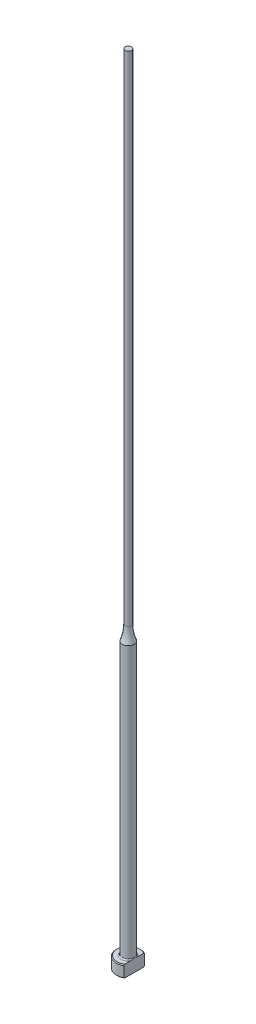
ISO-10303-21;
HEADER;
FILE_DESCRIPTION(('STEP AP214'),'2;1');
FILE_NAME('part.step','',(''),(''),'','','');
FILE_SCHEMA(('AUTOMOTIVE_DESIGN { 1 0 10303 214 1 1 1 1 }'));
ENDSEC;
DATA;
#1=APPLICATION_CONTEXT('core data for automotive mechanical design processes');
#2=APPLICATION_PROTOCOL_DEFINITION('international standard','automotive_design',2000,#1);
#3=PRODUCT_CONTEXT('',#1,'mechanical');
#4=PRODUCT('Part','Part','',(#3));
#5=PRODUCT_RELATED_PRODUCT_CATEGORY('part','',(#4));
#6=PRODUCT_DEFINITION_FORMATION('','',#4);
#7=PRODUCT_DEFINITION_CONTEXT('part definition',#1,'design');
#8=PRODUCT_DEFINITION('design','',#6,#7);
#9=PRODUCT_DEFINITION_SHAPE('','',#8);
#10=(LENGTH_UNIT() NAMED_UNIT(*) SI_UNIT(.MILLI.,.METRE.));
#11=(NAMED_UNIT(*) PLANE_ANGLE_UNIT() SI_UNIT($,.RADIAN.));
#12=(NAMED_UNIT(*) SI_UNIT($,.STERADIAN.) SOLID_ANGLE_UNIT());
#13=UNCERTAINTY_MEASURE_WITH_UNIT(LENGTH_MEASURE(1.E-05),#10,'distance_accuracy_value','');
#14=(GEOMETRIC_REPRESENTATION_CONTEXT(3) GLOBAL_UNCERTAINTY_ASSIGNED_CONTEXT((#13)) GLOBAL_UNIT_ASSIGNED_CONTEXT((#10,
#11,#12)) REPRESENTATION_CONTEXT('',''));
#15=CARTESIAN_POINT('',(0.,0.,0.));
#16=DIRECTION('',(0.,0.,1.));
#17=DIRECTION('',(1.,0.,0.));
#18=AXIS2_PLACEMENT_3D('',#15,#16,#17);
#19=CARTESIAN_POINT('',(-2.99999999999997,3.,0.));
#20=DIRECTION('',(0.,1.,0.));
#21=DIRECTION('',(0.,0.,1.));
#22=AXIS2_PLACEMENT_3D('',#19,#20,#21);
#23=PLANE('',#22);
#24=CARTESIAN_POINT('',(0.,3.,0.));
#25=DIRECTION('',(0.,1.,0.));
#26=DIRECTION('',(0.,0.,1.));
#27=AXIS2_PLACEMENT_3D('',#24,#25,#26);
#28=CIRCLE('',#27,2.79999999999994);
#29=CARTESIAN_POINT('',(1.49999999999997,3.,-2.36431808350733));
#30=VERTEX_POINT('',#29);
#31=CARTESIAN_POINT('',(1.49999999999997,3.,2.36431808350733));
#32=VERTEX_POINT('',#31);
#33=EDGE_CURVE('E187',#30,#32,#28,.T.);
#34=ORIENTED_EDGE('',*,*,#33,.T.);
#35=DIRECTION('',(0.,0.,-1.));
#36=VECTOR('',#35,1.);
#37=CARTESIAN_POINT('',(1.49999999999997,3.,0.));
#38=LINE('',#37,#36);
#39=CARTESIAN_POINT('',(1.49999999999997,3.00000000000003,0.99498743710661));
#40=VERTEX_POINT('',#39);
#41=EDGE_CURVE('E57',#32,#40,#38,.T.);
#42=ORIENTED_EDGE('',*,*,#41,.T.);
#43=CARTESIAN_POINT('',(0.,3.,0.));
#44=DIRECTION('',(0.,1.,0.));
#45=DIRECTION('',(0.,0.,1.));
#46=AXIS2_PLACEMENT_3D('',#43,#44,#45);
#47=CIRCLE('',#46,1.79999999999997);
#48=CARTESIAN_POINT('',(1.49999999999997,3.00000000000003,-0.994987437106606));
#49=VERTEX_POINT('',#48);
#50=EDGE_CURVE('E108',#40,#49,#47,.F.);
#51=ORIENTED_EDGE('',*,*,#50,.T.);
#52=EDGE_CURVE('E137',#49,#30,#38,.T.);
#53=ORIENTED_EDGE('',*,*,#52,.T.);
#54=EDGE_LOOP('',(#34,#42,#51,#53));
#55=FACE_BOUND('',#54,.T.);
#56=ADVANCED_FACE('F32',(#55),#23,.T.);
#57=CARTESIAN_POINT('',(0.,259.958771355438,0.));
#58=DIRECTION('',(0.,1.,0.));
#59=DIRECTION('',(0.,0.,1.));
#60=AXIS2_PLACEMENT_3D('',#57,#58,#59);
#61=CYLINDRICAL_SURFACE('',#60,2.99999999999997);
#62=CARTESIAN_POINT('',(0.,2.79999999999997,0.));
#63=DIRECTION('',(0.,1.,0.));
#64=DIRECTION('',(0.,0.,1.));
#65=AXIS2_PLACEMENT_3D('',#62,#63,#64);
#66=CIRCLE('',#65,2.99999999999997);
#67=CARTESIAN_POINT('',(1.49999999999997,2.79999999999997,2.5980762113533));
#68=VERTEX_POINT('',#67);
#69=CARTESIAN_POINT('',(1.49999999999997,2.79999999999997,-2.5980762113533));
#70=VERTEX_POINT('',#69);
#71=EDGE_CURVE('E105',#68,#70,#66,.F.);
#72=ORIENTED_EDGE('',*,*,#71,.T.);
#73=DIRECTION('',(0.,-1.,0.));
#74=VECTOR('',#73,1.);
#75=CARTESIAN_POINT('',(1.49999999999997,200.,-2.5980762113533));
#76=LINE('',#75,#74);
#77=CARTESIAN_POINT('',(1.49999999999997,0.200000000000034,-2.5980762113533));
#78=VERTEX_POINT('',#77);
#79=EDGE_CURVE('E193',#70,#78,#76,.T.);
#80=ORIENTED_EDGE('',*,*,#79,.T.);
#81=CARTESIAN_POINT('',(0.,0.200000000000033,0.));
#82=DIRECTION('',(0.,-1.,0.));
#83=DIRECTION('',(0.,0.,-1.));
#84=AXIS2_PLACEMENT_3D('',#81,#82,#83);
#85=CIRCLE('',#84,2.99999999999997);
#86=CARTESIAN_POINT('',(1.49999999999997,0.200000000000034,2.5980762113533));
#87=VERTEX_POINT('',#86);
#88=EDGE_CURVE('E100',#78,#87,#85,.F.);
#89=ORIENTED_EDGE('',*,*,#88,.T.);
#90=DIRECTION('',(0.,-1.,0.));
#91=VECTOR('',#90,1.);
#92=CARTESIAN_POINT('',(1.49999999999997,200.,2.5980762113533));
#93=LINE('',#92,#91);
#94=EDGE_CURVE('E93',#68,#87,#93,.T.);
#95=ORIENTED_EDGE('',*,*,#94,.F.);
#96=EDGE_LOOP('',(#72,#80,#89,#95));
#97=FACE_BOUND('',#96,.T.);
#98=ADVANCED_FACE('F158',(#97),#61,.T.);
#99=CARTESIAN_POINT('',(0.,0.,0.));
#100=DIRECTION('',(0.,-1.,0.));
#101=DIRECTION('',(0.,0.,-1.));
#102=AXIS2_PLACEMENT_3D('',#99,#100,#101);
#103=PLANE('',#102);
#104=CARTESIAN_POINT('',(0.,0.,0.));
#105=DIRECTION('',(0.,-1.,0.));
#106=DIRECTION('',(0.,0.,-1.));
#107=AXIS2_PLACEMENT_3D('',#104,#105,#106);
#108=CIRCLE('',#107,2.79999999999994);
#109=CARTESIAN_POINT('',(1.49999999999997,0.,2.36431808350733));
#110=VERTEX_POINT('',#109);
#111=CARTESIAN_POINT('',(1.49999999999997,0.,-2.36431808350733));
#112=VERTEX_POINT('',#111);
#113=EDGE_CURVE('E98',#110,#112,#108,.T.);
#114=ORIENTED_EDGE('',*,*,#113,.T.);
#115=DIRECTION('',(0.,0.,1.));
#116=VECTOR('',#115,1.);
#117=CARTESIAN_POINT('',(1.49999999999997,0.,-2.5980762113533));
#118=LINE('',#117,#116);
#119=EDGE_CURVE('E83',#112,#110,#118,.T.);
#120=ORIENTED_EDGE('',*,*,#119,.T.);
#121=EDGE_LOOP('',(#114,#120));
#122=FACE_BOUND('',#121,.T.);
#123=ADVANCED_FACE('F103',(#122),#103,.T.);
#124=CARTESIAN_POINT('',(0.,3.,0.));
#125=DIRECTION('',(0.,-1.,0.));
#126=DIRECTION('',(0.,0.,-1.));
#127=AXIS2_PLACEMENT_3D('',#124,#125,#126);
#128=CONICAL_SURFACE('',#127,2.79999999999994,0.785398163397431);
#129=ORIENTED_EDGE('',*,*,#71,.F.);
#130=CARTESIAN_POINT('',(1.49999999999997,-0.11174109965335,5.71827621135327));
#131=CARTESIAN_POINT('',(1.49999999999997,0.0136183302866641,5.58866816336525));
#132=CARTESIAN_POINT('',(1.49999999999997,0.138843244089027,5.45892957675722));
#133=CARTESIAN_POINT('',(1.49999999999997,0.388944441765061,5.19911365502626));
#134=CARTESIAN_POINT('',(1.49999999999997,0.513820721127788,5.06903631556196));
#135=CARTESIAN_POINT('',(1.49999999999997,0.763205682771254,4.80840180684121));
#136=CARTESIAN_POINT('',(1.49999999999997,0.887714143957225,4.67784442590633));
#137=CARTESIAN_POINT('',(1.49999999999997,1.13618059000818,4.4162081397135));
#138=CARTESIAN_POINT('',(1.49999999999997,1.26013857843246,4.28512923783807));
#139=CARTESIAN_POINT('',(1.49999999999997,1.50488975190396,4.02490837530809));
#140=CARTESIAN_POINT('',(1.49999999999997,1.62569693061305,3.8957795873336));
#141=CARTESIAN_POINT('',(1.49999999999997,1.86640694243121,3.63668213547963));
#142=CARTESIAN_POINT('',(1.49999999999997,1.98630978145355,3.50671347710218));
#143=CARTESIAN_POINT('',(1.49999999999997,2.2248603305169,3.24567921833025));
#144=CARTESIAN_POINT('',(1.49999999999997,2.3435083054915,3.11461386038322));
#145=CARTESIAN_POINT('',(1.49999999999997,2.5790771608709,2.85094268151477));
#146=CARTESIAN_POINT('',(1.49999999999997,2.69599811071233,2.71833692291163));
#147=CARTESIAN_POINT('',(1.49999999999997,2.88262371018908,2.50255231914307));
#148=CARTESIAN_POINT('',(1.49999999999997,2.95312454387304,2.42006293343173));
#149=CARTESIAN_POINT('',(1.49999999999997,3.09287098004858,2.25401084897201));
#150=CARTESIAN_POINT('',(1.49999999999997,3.16211645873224,2.17044804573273));
#151=CARTESIAN_POINT('',(1.49999999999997,3.29964684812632,2.00105967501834));
#152=CARTESIAN_POINT('',(1.49999999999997,3.36791386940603,1.9152195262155));
#153=CARTESIAN_POINT('',(1.49999999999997,3.50205840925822,1.7417139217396));
#154=CARTESIAN_POINT('',(1.49999999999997,3.56793649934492,1.65404891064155));
#155=CARTESIAN_POINT('',(1.49999999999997,3.69728151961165,1.47490236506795));
#156=CARTESIAN_POINT('',(1.49999999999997,3.76069661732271,1.38338308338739));
#157=CARTESIAN_POINT('',(1.49999999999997,3.88239539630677,1.19675661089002));
#158=CARTESIAN_POINT('',(1.49999999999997,3.94067201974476,1.10164473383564));
#159=CARTESIAN_POINT('',(1.49999999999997,4.048413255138,0.908008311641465));
#160=CARTESIAN_POINT('',(1.49999999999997,4.09797809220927,0.809540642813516));
#161=CARTESIAN_POINT('',(1.49999999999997,4.18432188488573,0.60719295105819));
#162=CARTESIAN_POINT('',(1.49999999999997,4.22114374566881,0.503332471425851));
#163=CARTESIAN_POINT('',(1.49999999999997,4.26099935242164,0.3475775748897));
#164=CARTESIAN_POINT('',(1.49999999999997,4.2715702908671,0.297609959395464));
#165=CARTESIAN_POINT('',(1.49999999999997,4.28794860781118,0.196885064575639));
#166=CARTESIAN_POINT('',(1.49999999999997,4.29375640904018,0.146127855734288));
#167=CARTESIAN_POINT('',(1.49999999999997,4.30019707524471,0.0444388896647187));
#168=CARTESIAN_POINT('',(1.49999999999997,4.30084594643,-0.00649183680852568));
#169=CARTESIAN_POINT('',(1.49999999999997,4.29696416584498,-0.108155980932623));
#170=CARTESIAN_POINT('',(1.49999999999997,4.29243308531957,-0.158889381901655));
#171=CARTESIAN_POINT('',(1.49999999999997,4.27856915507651,-0.259234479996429));
#172=CARTESIAN_POINT('',(1.49999999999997,4.2692782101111,-0.308852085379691));
#173=CARTESIAN_POINT('',(1.49999999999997,4.24647108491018,-0.407110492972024));
#174=CARTESIAN_POINT('',(1.49999999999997,4.23295324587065,-0.45575090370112));
#175=CARTESIAN_POINT('',(1.49999999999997,4.20226175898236,-0.55214996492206));
#176=CARTESIAN_POINT('',(1.49999999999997,4.18506801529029,-0.599902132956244));
#177=CARTESIAN_POINT('',(1.49999999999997,4.14771387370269,-0.694205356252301));
#178=CARTESIAN_POINT('',(1.49999999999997,4.12755408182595,-0.740756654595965));
#179=CARTESIAN_POINT('',(1.49999999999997,4.0632769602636,-0.879166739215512));
#180=CARTESIAN_POINT('',(1.49999999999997,4.01551721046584,-0.969329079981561));
#181=CARTESIAN_POINT('',(1.49999999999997,3.91367909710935,-1.14604316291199));
#182=CARTESIAN_POINT('',(1.49999999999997,3.85959300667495,-1.2325903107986));
#183=CARTESIAN_POINT('',(1.49999999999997,3.74697968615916,-1.40321348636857));
#184=CARTESIAN_POINT('',(1.49999999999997,3.68843573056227,-1.4872783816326));
#185=CARTESIAN_POINT('',(1.49999999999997,3.5684384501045,-1.65322187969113));
#186=CARTESIAN_POINT('',(1.49999999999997,3.50698656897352,-1.73510153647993));
#187=CARTESIAN_POINT('',(1.49999999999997,3.3811567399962,-1.89829823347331));
#188=CARTESIAN_POINT('',(1.49999999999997,3.31675092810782,-1.97959369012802));
#189=CARTESIAN_POINT('',(1.49999999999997,3.18634068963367,-2.14090082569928));
#190=CARTESIAN_POINT('',(1.49999999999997,3.12033609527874,-2.22091236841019));
#191=CARTESIAN_POINT('',(1.49999999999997,2.92086431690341,-2.45906508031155));
#192=CARTESIAN_POINT('',(1.49999999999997,2.78562663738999,-2.61572090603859));
#193=CARTESIAN_POINT('',(1.49999999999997,2.53554498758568,-2.90006295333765));
#194=CARTESIAN_POINT('',(1.49999999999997,2.42114543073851,-3.02814382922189));
#195=CARTESIAN_POINT('',(1.49999999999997,2.1909355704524,-3.28303767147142));
#196=CARTESIAN_POINT('',(1.49999999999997,2.07512522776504,-3.40985060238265));
#197=CARTESIAN_POINT('',(1.49999999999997,1.72597067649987,-3.78913849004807));
#198=CARTESIAN_POINT('',(1.49999999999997,1.49111760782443,-4.04022177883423));
#199=CARTESIAN_POINT('',(1.49999999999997,1.0288247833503,-4.52992803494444));
#200=CARTESIAN_POINT('',(1.49999999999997,0.801477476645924,-4.76863870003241));
#201=CARTESIAN_POINT('',(1.49999999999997,0.459548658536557,-5.12558036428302));
#202=CARTESIAN_POINT('',(1.49999999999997,0.345484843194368,-5.24430773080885));
#203=CARTESIAN_POINT('',(1.49999999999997,0.117071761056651,-5.48148573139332));
#204=CARTESIAN_POINT('',(1.49999999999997,0.00272249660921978,-5.59993636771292));
#205=CARTESIAN_POINT('',(1.49999999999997,-0.11174109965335,-5.71827621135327));
#206=B_SPLINE_CURVE_WITH_KNOTS('',3,(#130,#131,#132,#133,#134,#135,#136,#137,#138,#139,#140,
#141,#142,#143,#144,#145,#146,#147,#148,#149,#150,#151,#152,#153,#154,#155,#156,#157,#158,#159,
#160,#161,#162,#163,#164,#165,#166,#167,#168,#169,#170,#171,#172,#173,#174,#175,#176,#177,#178,
#179,#180,#181,#182,#183,#184,#185,#186,#187,#188,#189,#190,#191,#192,#193,#194,#195,#196,#197,
#198,#199,#200,#201,#202,#203,#204,#205),.UNSPECIFIED.,.F.,.F.,(4,2,2,2,2,2,2,2,2,2,2,2,2,2,2,2,
2,2,2,2,2,2,2,2,2,2,2,2,2,2,2,2,2,2,2,2,2,4),(0.,0.540943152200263,1.08189327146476,
1.62312052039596,2.16434426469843,2.69482920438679,3.22531067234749,3.75567781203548,
4.28602356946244,4.61155053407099,4.9371094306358,5.26610945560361,5.59503024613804,
5.92894782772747,6.26331713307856,6.59354403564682,6.92264800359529,7.07567478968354,
7.2286879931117,7.38122626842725,7.53377717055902,7.6850075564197,7.83629736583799,
7.98843643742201,8.14054446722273,8.44618799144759,8.75220879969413,9.05944044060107,
9.3665211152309,9.6776428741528,9.98879742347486,10.609592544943,11.1247803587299,
11.6399825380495,12.6713544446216,13.6603005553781,14.1542238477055,14.6481430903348),.UNSPECIFIED.);
#207=EDGE_CURVE('E136',#68,#32,#206,.T.);
#208=ORIENTED_EDGE('',*,*,#207,.T.);
#209=ORIENTED_EDGE('',*,*,#33,.F.);
#210=EDGE_CURVE('E128',#30,#70,#206,.T.);
#211=ORIENTED_EDGE('',*,*,#210,.T.);
#212=EDGE_LOOP('',(#129,#208,#209,#211));
#213=FACE_BOUND('',#212,.T.);
#214=ADVANCED_FACE('F144',(#213),#128,.T.);
#215=CARTESIAN_POINT('',(0.,0.200000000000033,0.));
#216=DIRECTION('',(0.,1.,0.));
#217=DIRECTION('',(0.,0.,1.));
#218=AXIS2_PLACEMENT_3D('',#215,#216,#217);
#219=CONICAL_SURFACE('',#218,2.99999999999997,0.785398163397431);
#220=ORIENTED_EDGE('',*,*,#88,.F.);
#221=CARTESIAN_POINT('',(1.49999999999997,3.11174109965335,-5.71827621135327));
#222=CARTESIAN_POINT('',(1.49999999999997,2.98638166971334,-5.58866816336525));
#223=CARTESIAN_POINT('',(1.49999999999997,2.86115675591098,-5.45892957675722));
#224=CARTESIAN_POINT('',(1.49999999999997,2.61105555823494,-5.19911365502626));
#225=CARTESIAN_POINT('',(1.49999999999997,2.48617927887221,-5.06903631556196));
#226=CARTESIAN_POINT('',(1.49999999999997,2.23679431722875,-4.80840180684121));
#227=CARTESIAN_POINT('',(1.49999999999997,2.11228585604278,-4.67784442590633));
#228=CARTESIAN_POINT('',(1.49999999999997,1.86381940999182,-4.4162081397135));
#229=CARTESIAN_POINT('',(1.49999999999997,1.73986142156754,-4.28512923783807));
#230=CARTESIAN_POINT('',(1.49999999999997,1.49511024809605,-4.02490837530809));
#231=CARTESIAN_POINT('',(1.49999999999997,1.37430306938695,-3.8957795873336));
#232=CARTESIAN_POINT('',(1.49999999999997,1.13359305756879,-3.63668213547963));
#233=CARTESIAN_POINT('',(1.49999999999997,1.01369021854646,-3.50671347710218));
#234=CARTESIAN_POINT('',(1.49999999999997,0.775139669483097,-3.24567921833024));
#235=CARTESIAN_POINT('',(1.49999999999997,0.656491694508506,-3.11461386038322));
#236=CARTESIAN_POINT('',(1.49999999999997,0.420922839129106,-2.85094268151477));
#237=CARTESIAN_POINT('',(1.49999999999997,0.304001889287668,-2.71833692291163));
#238=CARTESIAN_POINT('',(1.49999999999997,0.117376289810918,-2.50255231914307));
#239=CARTESIAN_POINT('',(1.49999999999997,0.0468754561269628,-2.42006293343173));
#240=CARTESIAN_POINT('',(1.49999999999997,-0.0928709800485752,-2.254010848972));
#241=CARTESIAN_POINT('',(1.49999999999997,-0.162116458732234,-2.17044804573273));
#242=CARTESIAN_POINT('',(1.49999999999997,-0.299646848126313,-2.00105967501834));
#243=CARTESIAN_POINT('',(1.49999999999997,-0.367913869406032,-1.9152195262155));
#244=CARTESIAN_POINT('',(1.49999999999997,-0.502058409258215,-1.7417139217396));
#245=CARTESIAN_POINT('',(1.49999999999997,-0.567936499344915,-1.65404891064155));
#246=CARTESIAN_POINT('',(1.49999999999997,-0.697281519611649,-1.47490236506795));
#247=CARTESIAN_POINT('',(1.49999999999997,-0.760696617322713,-1.38338308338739));
#248=CARTESIAN_POINT('',(1.49999999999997,-0.882395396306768,-1.19675661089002));
#249=CARTESIAN_POINT('',(1.49999999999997,-0.940672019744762,-1.10164473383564));
#250=CARTESIAN_POINT('',(1.49999999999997,-1.04841325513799,-0.908008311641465));
#251=CARTESIAN_POINT('',(1.49999999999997,-1.09797809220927,-0.809540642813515));
#252=CARTESIAN_POINT('',(1.49999999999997,-1.18432188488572,-0.607192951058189));
#253=CARTESIAN_POINT('',(1.49999999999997,-1.22114374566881,-0.503332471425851));
#254=CARTESIAN_POINT('',(1.49999999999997,-1.26099935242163,-0.3475775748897));
#255=CARTESIAN_POINT('',(1.49999999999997,-1.2715702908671,-0.297609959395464));
#256=CARTESIAN_POINT('',(1.49999999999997,-1.28794860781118,-0.19688506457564));
#257=CARTESIAN_POINT('',(1.49999999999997,-1.29375640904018,-0.146127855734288));
#258=CARTESIAN_POINT('',(1.49999999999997,-1.30019707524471,-0.0444388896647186));
#259=CARTESIAN_POINT('',(1.49999999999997,-1.30084594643,0.00649183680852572));
#260=CARTESIAN_POINT('',(1.49999999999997,-1.29696416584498,0.108155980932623));
#261=CARTESIAN_POINT('',(1.49999999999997,-1.29243308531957,0.158889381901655));
#262=CARTESIAN_POINT('',(1.49999999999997,-1.2785691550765,0.259234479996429));
#263=CARTESIAN_POINT('',(1.49999999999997,-1.2692782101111,0.308852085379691));
#264=CARTESIAN_POINT('',(1.49999999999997,-1.24647108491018,0.407110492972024));
#265=CARTESIAN_POINT('',(1.49999999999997,-1.23295324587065,0.45575090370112));
#266=CARTESIAN_POINT('',(1.49999999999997,-1.20226175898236,0.55214996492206));
#267=CARTESIAN_POINT('',(1.49999999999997,-1.18506801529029,0.599902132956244));
#268=CARTESIAN_POINT('',(1.49999999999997,-1.14771387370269,0.694205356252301));
#269=CARTESIAN_POINT('',(1.49999999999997,-1.12755408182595,0.740756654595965));
#270=CARTESIAN_POINT('',(1.49999999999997,-1.0632769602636,0.879166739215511));
#271=CARTESIAN_POINT('',(1.49999999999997,-1.01551721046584,0.96932907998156));
#272=CARTESIAN_POINT('',(1.49999999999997,-0.913679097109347,1.14604316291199));
#273=CARTESIAN_POINT('',(1.49999999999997,-0.85959300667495,1.2325903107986));
#274=CARTESIAN_POINT('',(1.49999999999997,-0.74697968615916,1.40321348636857));
#275=CARTESIAN_POINT('',(1.49999999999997,-0.688435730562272,1.4872783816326));
#276=CARTESIAN_POINT('',(1.49999999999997,-0.568438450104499,1.65322187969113));
#277=CARTESIAN_POINT('',(1.49999999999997,-0.50698656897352,1.73510153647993));
#278=CARTESIAN_POINT('',(1.49999999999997,-0.381156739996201,1.89829823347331));
#279=CARTESIAN_POINT('',(1.49999999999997,-0.316750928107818,1.97959369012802));
#280=CARTESIAN_POINT('',(1.49999999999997,-0.186340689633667,2.14090082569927));
#281=CARTESIAN_POINT('',(1.49999999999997,-0.120336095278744,2.22091236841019));
#282=CARTESIAN_POINT('',(1.49999999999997,0.0791356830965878,2.45906508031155));
#283=CARTESIAN_POINT('',(1.49999999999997,0.214373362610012,2.61572090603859));
#284=CARTESIAN_POINT('',(1.49999999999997,0.464455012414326,2.90006295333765));
#285=CARTESIAN_POINT('',(1.49999999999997,0.578854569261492,3.02814382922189));
#286=CARTESIAN_POINT('',(1.49999999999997,0.809064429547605,3.28303767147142));
#287=CARTESIAN_POINT('',(1.49999999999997,0.924874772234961,3.40985060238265));
#288=CARTESIAN_POINT('',(1.49999999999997,1.27402932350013,3.78913849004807));
#289=CARTESIAN_POINT('',(1.49999999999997,1.50888239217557,4.04022177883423));
#290=CARTESIAN_POINT('',(1.49999999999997,1.97117521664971,4.52992803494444));
#291=CARTESIAN_POINT('',(1.49999999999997,2.19852252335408,4.76863870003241));
#292=CARTESIAN_POINT('',(1.49999999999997,2.54045134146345,5.12558036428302));
#293=CARTESIAN_POINT('',(1.49999999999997,2.65451515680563,5.24430773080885));
#294=CARTESIAN_POINT('',(1.49999999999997,2.88292823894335,5.48148573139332));
#295=CARTESIAN_POINT('',(1.49999999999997,2.99727750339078,5.59993636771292));
#296=CARTESIAN_POINT('',(1.49999999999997,3.11174109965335,5.71827621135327));
#297=B_SPLINE_CURVE_WITH_KNOTS('',3,(#221,#222,#223,#224,#225,#226,#227,#228,#229,#230,#231,
#232,#233,#234,#235,#236,#237,#238,#239,#240,#241,#242,#243,#244,#245,#246,#247,#248,#249,#250,
#251,#252,#253,#254,#255,#256,#257,#258,#259,#260,#261,#262,#263,#264,#265,#266,#267,#268,#269,
#270,#271,#272,#273,#274,#275,#276,#277,#278,#279,#280,#281,#282,#283,#284,#285,#286,#287,#288,
#289,#290,#291,#292,#293,#294,#295,#296),.UNSPECIFIED.,.F.,.F.,(4,2,2,2,2,2,2,2,2,2,2,2,2,2,2,2,
2,2,2,2,2,2,2,2,2,2,2,2,2,2,2,2,2,2,2,2,2,4),(0.,0.540943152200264,1.08189327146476,
1.62312052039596,2.16434426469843,2.69482920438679,3.22531067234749,3.75567781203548,
4.28602356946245,4.611550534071,4.9371094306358,5.26610945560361,5.59503024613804,
5.92894782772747,6.26331713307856,6.59354403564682,6.92264800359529,7.07567478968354,
7.2286879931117,7.38122626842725,7.53377717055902,7.6850075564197,7.83629736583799,
7.98843643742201,8.14054446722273,8.44618799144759,8.75220879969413,9.05944044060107,
9.3665211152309,9.6776428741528,9.98879742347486,10.609592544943,11.1247803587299,
11.6399825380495,12.6713544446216,13.6603005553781,14.1542238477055,14.6481430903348),.UNSPECIFIED.);
#298=EDGE_CURVE('E86',#78,#112,#297,.T.);
#299=ORIENTED_EDGE('',*,*,#298,.T.);
#300=ORIENTED_EDGE('',*,*,#113,.F.);
#301=EDGE_CURVE('E89',#110,#87,#297,.T.);
#302=ORIENTED_EDGE('',*,*,#301,.T.);
#303=EDGE_LOOP('',(#220,#299,#300,#302));
#304=FACE_BOUND('',#303,.T.);
#305=ADVANCED_FACE('F97',(#304),#219,.T.);
#306=CARTESIAN_POINT('',(0.,3.30000000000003,0.));
#307=DIRECTION('',(0.,1.,0.));
#308=DIRECTION('',(0.,0.,1.));
#309=AXIS2_PLACEMENT_3D('',#306,#307,#308);
#310=TOROIDAL_SURFACE('',#309,1.79999999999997,0.3);
#311=CARTESIAN_POINT('',(1.49999999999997,3.30000000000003,0.));
#312=CARTESIAN_POINT('',(1.49999999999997,3.300000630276,3.41555678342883E-12));
#313=CARTESIAN_POINT('',(1.49999999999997,3.30000126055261,-1.15373640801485E-07));
#314=CARTESIAN_POINT('',(1.49999999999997,3.3000024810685,-4.90631575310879E-07));
#315=CARTESIAN_POINT('',(1.49999999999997,3.30000307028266,-7.53296670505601E-07));
#316=CARTESIAN_POINT('',(1.49999999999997,3.30000424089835,-1.38757096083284E-06));
#317=CARTESIAN_POINT('',(1.49999999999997,3.300004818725,-1.76563001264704E-06));
#318=CARTESIAN_POINT('',(1.49999999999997,3.30000591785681,-2.58768006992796E-06));
#319=CARTESIAN_POINT('',(1.49999999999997,3.30000643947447,-3.03127014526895E-06));
#320=CARTESIAN_POINT('',(1.49999999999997,3.30000815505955,-4.60021967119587E-06));
#321=CARTESIAN_POINT('',(1.49999999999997,3.30000927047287,-5.8124152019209E-06));
#322=CARTESIAN_POINT('',(1.49999999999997,3.30001128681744,-8.33989413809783E-06));
#323=CARTESIAN_POINT('',(1.49999999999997,3.30001219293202,-9.65128157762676E-06));
#324=CARTESIAN_POINT('',(1.49999999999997,3.30001551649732,-1.46782505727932E-05));
#325=CARTESIAN_POINT('',(1.49999999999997,3.30001775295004,-1.8517976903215E-05));
#326=CARTESIAN_POINT('',(1.49999999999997,3.30002148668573,-2.61616194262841E-05));
#327=CARTESIAN_POINT('',(1.49999999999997,3.30002302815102,-2.99447742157E-05));
#328=CARTESIAN_POINT('',(1.49999999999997,3.30002943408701,-4.58003743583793E-05));
#329=CARTESIAN_POINT('',(1.49999999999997,3.3000341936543,-5.79079078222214E-05));
#330=CARTESIAN_POINT('',(1.49999999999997,3.30004197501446,-8.07263755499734E-05));
#331=CARTESIAN_POINT('',(1.49999999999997,3.30004514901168,-9.13834709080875E-05));
#332=CARTESIAN_POINT('',(1.49999999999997,3.30006989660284,-0.000167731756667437));
#333=CARTESIAN_POINT('',(1.49999999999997,3.30010092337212,-0.000229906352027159));
#334=CARTESIAN_POINT('',(1.49999999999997,3.30021632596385,-0.000470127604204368));
#335=CARTESIAN_POINT('',(1.49999999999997,3.30029368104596,-0.000650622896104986));
#336=CARTESIAN_POINT('',(1.49999999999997,3.30059619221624,-0.00134589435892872));
#337=CARTESIAN_POINT('',(1.49999999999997,3.30082870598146,-0.00185814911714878));
#338=CARTESIAN_POINT('',(1.49999999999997,3.30176696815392,-0.00393547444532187));
#339=CARTESIAN_POINT('',(1.49999999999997,3.30246445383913,-0.00550332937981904));
#340=CARTESIAN_POINT('',(1.49999999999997,3.31426785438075,-0.0320229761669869));
#341=CARTESIAN_POINT('',(1.49999999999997,3.32544800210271,-0.0569503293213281));
#342=CARTESIAN_POINT('',(1.49999999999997,3.34725700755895,-0.105984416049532));
#343=CARTESIAN_POINT('',(1.49999999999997,3.35789134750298,-0.130088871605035));
#344=CARTESIAN_POINT('',(1.49999999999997,3.38015321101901,-0.181096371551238));
#345=CARTESIAN_POINT('',(1.49999999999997,3.39175804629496,-0.208009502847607));
#346=CARTESIAN_POINT('',(1.49999999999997,3.41469034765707,-0.262264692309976));
#347=CARTESIAN_POINT('',(1.49999999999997,3.42601398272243,-0.289608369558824));
#348=CARTESIAN_POINT('',(1.49999999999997,3.45363212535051,-0.35820378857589));
#349=CARTESIAN_POINT('',(1.49999999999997,3.46959026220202,-0.39959288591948));
#350=CARTESIAN_POINT('',(1.49999999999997,3.49940505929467,-0.482097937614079));
#351=CARTESIAN_POINT('',(1.49999999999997,3.51330033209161,-0.523199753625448));
#352=CARTESIAN_POINT('',(1.49999999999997,3.53552507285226,-0.595497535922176));
#353=CARTESIAN_POINT('',(1.49999999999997,3.54436834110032,-0.626532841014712));
#354=CARTESIAN_POINT('',(1.49999999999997,3.56052427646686,-0.6891760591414));
#355=CARTESIAN_POINT('',(1.49999999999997,3.5678279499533,-0.720786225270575));
#356=CARTESIAN_POINT('',(1.49999999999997,3.5875075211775,-0.819524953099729));
#357=CARTESIAN_POINT('',(1.49999999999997,3.59661044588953,-0.88742909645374));
#358=CARTESIAN_POINT('',(1.49999999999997,3.60059842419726,-0.991180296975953));
#359=CARTESIAN_POINT('',(1.49999999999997,3.60019840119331,-1.02684364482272));
#360=CARTESIAN_POINT('',(1.49999999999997,3.59497085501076,-1.097505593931));
#361=CARTESIAN_POINT('',(1.49999999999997,3.59019295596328,-1.13250716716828));
#362=CARTESIAN_POINT('',(1.49999999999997,3.57687734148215,-1.19353096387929));
#363=CARTESIAN_POINT('',(1.49999999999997,3.56943875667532,-1.21978854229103));
#364=CARTESIAN_POINT('',(1.49999999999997,3.55063748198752,-1.27094658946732));
#365=CARTESIAN_POINT('',(1.49999999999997,3.53927342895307,-1.29584658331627));
#366=CARTESIAN_POINT('',(1.49999999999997,3.51660016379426,-1.33501873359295));
#367=CARTESIAN_POINT('',(1.49999999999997,3.50657738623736,-1.35003296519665));
#368=CARTESIAN_POINT('',(1.49999999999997,3.48437469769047,-1.37837252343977));
#369=CARTESIAN_POINT('',(1.49999999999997,3.47219867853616,-1.39170082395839));
#370=CARTESIAN_POINT('',(1.49999999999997,3.44835614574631,-1.41349417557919));
#371=CARTESIAN_POINT('',(1.49999999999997,3.43709185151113,-1.42239673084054));
#372=CARTESIAN_POINT('',(1.49999999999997,3.41325256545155,-1.43825467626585));
#373=CARTESIAN_POINT('',(1.49999999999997,3.40067804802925,-1.44521076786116));
#374=CARTESIAN_POINT('',(1.49999999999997,3.37433767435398,-1.45677158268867));
#375=CARTESIAN_POINT('',(1.49999999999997,3.36056203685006,-1.46135438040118));
#376=CARTESIAN_POINT('',(1.49999999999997,3.33237324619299,-1.46767730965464));
#377=CARTESIAN_POINT('',(1.49999999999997,3.31796076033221,-1.46942034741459));
#378=CARTESIAN_POINT('',(1.49999999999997,3.29122479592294,-1.4698720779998));
#379=CARTESIAN_POINT('',(1.49999999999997,3.27890664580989,-1.468990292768));
#380=CARTESIAN_POINT('',(1.49999999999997,3.25461019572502,-1.4651157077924));
#381=CARTESIAN_POINT('',(1.49999999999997,3.2426318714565,-1.46212305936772));
#382=CARTESIAN_POINT('',(1.49999999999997,3.21959683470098,-1.4543117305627));
#383=CARTESIAN_POINT('',(1.49999999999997,3.20852542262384,-1.44953579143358));
#384=CARTESIAN_POINT('',(1.49999999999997,3.18721125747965,-1.43840957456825));
#385=CARTESIAN_POINT('',(1.49999999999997,3.1769687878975,-1.43205876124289));
#386=CARTESIAN_POINT('',(1.49999999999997,3.15325976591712,-1.41506353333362));
#387=CARTESIAN_POINT('',(1.49999999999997,3.14027750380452,-1.40374235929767));
#388=CARTESIAN_POINT('',(1.49999999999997,3.11630720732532,-1.37914825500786));
#389=CARTESIAN_POINT('',(1.49999999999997,3.10532420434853,-1.36587054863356));
#390=CARTESIAN_POINT('',(1.49999999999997,3.08100891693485,-1.33197272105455));
#391=CARTESIAN_POINT('',(1.49999999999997,3.06867625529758,-1.31063843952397));
#392=CARTESIAN_POINT('',(1.49999999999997,3.04751867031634,-1.26637455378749));
#393=CARTESIAN_POINT('',(1.49999999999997,3.03869240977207,-1.24344556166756));
#394=CARTESIAN_POINT('',(1.49999999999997,3.01978360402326,-1.18316534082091));
#395=CARTESIAN_POINT('',(1.49999999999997,3.01191472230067,-1.14512623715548));
#396=CARTESIAN_POINT('',(1.49999999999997,3.00188285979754,-1.06789971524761));
#397=CARTESIAN_POINT('',(1.49999999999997,2.99979735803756,-1.02870374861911));
#398=CARTESIAN_POINT('',(1.49999999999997,3.00021727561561,-0.953160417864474));
#399=CARTESIAN_POINT('',(1.49999999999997,3.00240673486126,-0.916808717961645));
#400=CARTESIAN_POINT('',(1.49999999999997,3.0099643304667,-0.844432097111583));
#401=CARTESIAN_POINT('',(1.49999999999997,3.01533462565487,-0.808407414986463));
#402=CARTESIAN_POINT('',(1.49999999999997,3.02828086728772,-0.738670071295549));
#403=CARTESIAN_POINT('',(1.49999999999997,3.03573028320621,-0.704933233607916));
#404=CARTESIAN_POINT('',(1.49999999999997,3.05243174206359,-0.638128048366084));
#405=CARTESIAN_POINT('',(1.49999999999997,3.06167285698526,-0.605056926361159));
#406=CARTESIAN_POINT('',(1.49999999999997,3.08440652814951,-0.53019513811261));
#407=CARTESIAN_POINT('',(1.49999999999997,3.09836576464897,-0.488547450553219));
#408=CARTESIAN_POINT('',(1.49999999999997,3.1283820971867,-0.404954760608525));
#409=CARTESIAN_POINT('',(1.49999999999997,3.14447968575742,-0.363024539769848));
#410=CARTESIAN_POINT('',(1.49999999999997,3.17238454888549,-0.293508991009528));
#411=CARTESIAN_POINT('',(1.49999999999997,3.18384249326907,-0.265781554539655));
#412=CARTESIAN_POINT('',(1.49999999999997,3.20705854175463,-0.210769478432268));
#413=CARTESIAN_POINT('',(1.49999999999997,3.21881265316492,-0.183483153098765));
#414=CARTESIAN_POINT('',(1.49999999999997,3.24136702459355,-0.131772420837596));
#415=CARTESIAN_POINT('',(1.49999999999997,3.25214361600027,-0.107337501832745));
#416=CARTESIAN_POINT('',(1.49999999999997,3.27424746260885,-0.0576321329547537));
#417=CARTESIAN_POINT('',(1.49999999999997,3.28558038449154,-0.0323640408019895));
#418=CARTESIAN_POINT('',(1.49999999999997,3.29753556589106,-0.00550327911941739));
#419=CARTESIAN_POINT('',(1.49999999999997,3.29823307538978,-0.00393537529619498));
#420=CARTESIAN_POINT('',(1.49999999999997,3.29917134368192,-0.00185803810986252));
#421=CARTESIAN_POINT('',(1.49999999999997,3.29940384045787,-0.00134582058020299));
#422=CARTESIAN_POINT('',(1.49999999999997,3.29970633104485,-0.000650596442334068));
#423=CARTESIAN_POINT('',(1.49999999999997,3.29978368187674,-0.000470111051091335));
#424=CARTESIAN_POINT('',(1.49999999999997,3.29989907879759,-0.000229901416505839));
#425=CARTESIAN_POINT('',(1.49999999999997,3.29993010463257,-0.000167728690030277));
#426=CARTESIAN_POINT('',(1.49999999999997,3.29995485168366,-9.13825689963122E-05));
#427=CARTESIAN_POINT('',(1.49999999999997,3.29995802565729,-8.07256241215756E-05));
#428=CARTESIAN_POINT('',(1.49999999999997,3.29996580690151,-5.79074820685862E-05));
#429=CARTESIAN_POINT('',(1.49999999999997,3.29997056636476,-4.5800119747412E-05));
#430=CARTESIAN_POINT('',(1.49999999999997,3.29997697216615,-2.99447119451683E-05));
#431=CARTESIAN_POINT('',(1.49999999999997,3.2999785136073,-2.61615817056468E-05));
#432=CARTESIAN_POINT('',(1.49999999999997,3.2999822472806,-1.85179845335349E-05));
#433=CARTESIAN_POINT('',(1.49999999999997,3.29998448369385,-1.46782782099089E-05));
#434=CARTESIAN_POINT('',(1.49999999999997,3.2999878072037,-9.65132752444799E-06));
#435=CARTESIAN_POINT('',(1.49999999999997,3.299988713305,-8.33994202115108E-06));
#436=CARTESIAN_POINT('',(1.49999999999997,3.29999072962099,-5.81246426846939E-06));
#437=CARTESIAN_POINT('',(1.49999999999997,3.29999184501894,-4.600267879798E-06));
#438=CARTESIAN_POINT('',(1.49999999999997,3.29999356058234,-3.03131394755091E-06));
#439=CARTESIAN_POINT('',(1.49999999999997,3.29999408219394,-2.58772196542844E-06));
#440=CARTESIAN_POINT('',(1.49999999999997,3.2999951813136,-1.76566701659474E-06));
#441=CARTESIAN_POINT('',(1.49999999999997,3.29999575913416,-1.38760497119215E-06));
#442=CARTESIAN_POINT('',(1.49999999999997,3.29999692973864,-7.53323425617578E-07));
#443=CARTESIAN_POINT('',(1.49999999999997,3.29999751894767,-4.90654189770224E-07));
#444=CARTESIAN_POINT('',(1.49999999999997,3.29999873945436,-1.15386267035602E-07));
#445=CARTESIAN_POINT('',(1.49999999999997,3.29999936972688,-3.41554144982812E-12));
#446=CARTESIAN_POINT('',(1.49999999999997,3.30000000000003,0.));
#447=B_SPLINE_CURVE_WITH_KNOTS('',3,(#311,#312,#313,#314,#315,#316,#317,#318,#319,#320,#321,
#322,#323,#324,#325,#326,#327,#328,#329,#330,#331,#332,#333,#334,#335,#336,#337,#338,#339,#340,
#341,#342,#343,#344,#345,#346,#347,#348,#349,#350,#351,#352,#353,#354,#355,#356,#357,#358,#359,
#360,#361,#362,#363,#364,#365,#366,#367,#368,#369,#370,#371,#372,#373,#374,#375,#376,#377,#378,
#379,#380,#381,#382,#383,#384,#385,#386,#387,#388,#389,#390,#391,#392,#393,#394,#395,#396,#397,
#398,#399,#400,#401,#402,#403,#404,#405,#406,#407,#408,#409,#410,#411,#412,#413,#414,#415,#416,
#417,#418,#419,#420,#421,#422,#423,#424,#425,#426,#427,#428,#429,#430,#431,#432,#433,#434,#435,
#436,#437,#438,#439,#440,#441,#442,#443,#444,#445,#446),.UNSPECIFIED.,.T.,.F.,(4,2,2,2,2,2,2,2,
2,2,2,2,2,2,2,2,2,2,2,2,2,2,2,2,2,2,2,2,2,2,2,2,2,2,2,2,2,2,2,2,2,2,2,2,2,2,2,2,2,2,2,2,2,2,2,2,
2,2,2,2,2,2,2,2,2,2,2,4),(0.,1.88906036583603E-06,3.8150959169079E-06,5.87892837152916E-06,
7.93062024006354E-06,1.28480890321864E-05,1.76261717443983E-05,3.0909918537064E-05,
4.31529750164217E-05,8.21699329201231E-05,0.000115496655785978,0.000323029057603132,
0.000912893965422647,0.00259963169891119,0.00774858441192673,0.0896975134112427,
0.168737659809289,0.256660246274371,0.345444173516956,0.478492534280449,0.608603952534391,
0.705372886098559,0.802692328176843,1.00719557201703,1.11399616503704,1.21960092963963,
1.30124317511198,1.38291380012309,1.43690814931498,1.49080588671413,1.53371524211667,
1.57660911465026,1.61989249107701,1.66313154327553,1.69999492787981,1.73685567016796,
1.77288440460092,1.80892540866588,1.86031324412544,1.91182866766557,1.98534297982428,
2.05882922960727,2.1747172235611,2.29215041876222,2.40123170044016,2.51038710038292,
2.613972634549,2.71694519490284,2.84866234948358,2.98337525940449,3.07337666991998,
3.16250453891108,3.24262397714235,3.32569301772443,3.3308421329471,3.33252874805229,
3.33311858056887,3.33332610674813,3.33335943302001,3.33339844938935,3.3334106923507,
3.33342397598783,3.33342875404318,3.33343367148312,3.33343572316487,3.33343778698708,
3.33343971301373,3.33344160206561),.UNSPECIFIED.);
#448=CARTESIAN_POINT('',(1.49999999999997,3.30000000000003,0.));
#449=VERTEX_POINT('',#448);
#450=EDGE_CURVE('E11',#49,#449,#447,.T.);
#451=ORIENTED_EDGE('',*,*,#450,.F.);
#452=ORIENTED_EDGE('',*,*,#50,.F.);
#453=CARTESIAN_POINT('',(1.49999999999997,3.30000000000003,0.));
#454=CARTESIAN_POINT('',(1.49999999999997,3.29999936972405,-3.41547770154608E-12));
#455=CARTESIAN_POINT('',(1.49999999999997,3.29999873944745,1.15373640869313E-07));
#456=CARTESIAN_POINT('',(1.49999999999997,3.29999751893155,4.90631575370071E-07));
#457=CARTESIAN_POINT('',(1.49999999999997,3.29999692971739,7.53296670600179E-07));
#458=CARTESIAN_POINT('',(1.49999999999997,3.2999957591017,1.38757096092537E-06));
#459=CARTESIAN_POINT('',(1.49999999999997,3.29999518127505,1.76563001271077E-06));
#460=CARTESIAN_POINT('',(1.49999999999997,3.29999408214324,2.58768007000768E-06));
#461=CARTESIAN_POINT('',(1.49999999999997,3.29999356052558,3.03127014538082E-06));
#462=CARTESIAN_POINT('',(1.49999999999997,3.2999918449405,4.60021967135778E-06));
#463=CARTESIAN_POINT('',(1.49999999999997,3.29999072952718,5.81241520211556E-06));
#464=CARTESIAN_POINT('',(1.49999999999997,3.29998871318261,8.33989413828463E-06));
#465=CARTESIAN_POINT('',(1.49999999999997,3.29998780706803,9.65128157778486E-06));
#466=CARTESIAN_POINT('',(1.49999999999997,3.29998448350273,1.46782505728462E-05));
#467=CARTESIAN_POINT('',(1.49999999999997,3.29998224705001,1.85179769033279E-05));
#468=CARTESIAN_POINT('',(1.49999999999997,3.29997851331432,2.61616194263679E-05));
#469=CARTESIAN_POINT('',(1.49999999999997,3.29997697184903,2.99447742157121E-05));
#470=CARTESIAN_POINT('',(1.49999999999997,3.29997056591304,4.58003743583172E-05));
#471=CARTESIAN_POINT('',(1.49999999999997,3.29996580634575,5.79079078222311E-05));
#472=CARTESIAN_POINT('',(1.49999999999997,3.29995802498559,8.07263755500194E-05));
#473=CARTESIAN_POINT('',(1.49999999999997,3.29995485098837,9.1383470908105E-05));
#474=CARTESIAN_POINT('',(1.49999999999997,3.29993010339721,0.000167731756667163));
#475=CARTESIAN_POINT('',(1.49999999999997,3.29989907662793,0.000229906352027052));
#476=CARTESIAN_POINT('',(1.49999999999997,3.2997836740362,0.000470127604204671));
#477=CARTESIAN_POINT('',(1.49999999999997,3.2997063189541,0.000650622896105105));
#478=CARTESIAN_POINT('',(1.49999999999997,3.29940380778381,0.00134589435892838));
#479=CARTESIAN_POINT('',(1.49999999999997,3.29917129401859,0.00185814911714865));
#480=CARTESIAN_POINT('',(1.49999999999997,3.29823303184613,0.00393547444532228));
#481=CARTESIAN_POINT('',(1.49999999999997,3.29753554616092,0.00550332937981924));
#482=CARTESIAN_POINT('',(1.49999999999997,3.2857321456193,0.0320229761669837));
#483=CARTESIAN_POINT('',(1.49999999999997,3.27455199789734,0.0569503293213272));
#484=CARTESIAN_POINT('',(1.49999999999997,3.2527429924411,0.105984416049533));
#485=CARTESIAN_POINT('',(1.49999999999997,3.24210865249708,0.130088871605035));
#486=CARTESIAN_POINT('',(1.49999999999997,3.21984678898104,0.181096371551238));
#487=CARTESIAN_POINT('',(1.49999999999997,3.20824195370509,0.208009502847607));
#488=CARTESIAN_POINT('',(1.49999999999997,3.18530965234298,0.262264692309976));
#489=CARTESIAN_POINT('',(1.49999999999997,3.17398601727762,0.289608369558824));
#490=CARTESIAN_POINT('',(1.49999999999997,3.14636787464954,0.35820378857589));
#491=CARTESIAN_POINT('',(1.49999999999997,3.13040973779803,0.39959288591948));
#492=CARTESIAN_POINT('',(1.49999999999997,3.10059494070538,0.482097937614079));
#493=CARTESIAN_POINT('',(1.49999999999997,3.08669966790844,0.523199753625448));
#494=CARTESIAN_POINT('',(1.49999999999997,3.06447492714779,0.595497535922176));
#495=CARTESIAN_POINT('',(1.49999999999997,3.05563165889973,0.626532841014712));
#496=CARTESIAN_POINT('',(1.49999999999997,3.03947572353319,0.6891760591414));
#497=CARTESIAN_POINT('',(1.49999999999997,3.03217205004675,0.720786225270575));
#498=CARTESIAN_POINT('',(1.49999999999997,3.01249247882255,0.819524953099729));
#499=CARTESIAN_POINT('',(1.49999999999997,3.00338955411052,0.88742909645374));
#500=CARTESIAN_POINT('',(1.49999999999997,2.99940157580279,0.991180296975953));
#501=CARTESIAN_POINT('',(1.49999999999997,2.99980159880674,1.02684364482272));
#502=CARTESIAN_POINT('',(1.49999999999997,3.00502914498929,1.097505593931));
#503=CARTESIAN_POINT('',(1.49999999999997,3.00980704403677,1.13250716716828));
#504=CARTESIAN_POINT('',(1.49999999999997,3.0231226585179,1.19353096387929));
#505=CARTESIAN_POINT('',(1.49999999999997,3.03056124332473,1.21978854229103));
#506=CARTESIAN_POINT('',(1.49999999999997,3.04936251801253,1.27094658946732));
#507=CARTESIAN_POINT('',(1.49999999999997,3.06072657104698,1.29584658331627));
#508=CARTESIAN_POINT('',(1.49999999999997,3.08339983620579,1.33501873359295));
#509=CARTESIAN_POINT('',(1.49999999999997,3.09342261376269,1.35003296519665));
#510=CARTESIAN_POINT('',(1.49999999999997,3.11562530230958,1.37837252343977));
#511=CARTESIAN_POINT('',(1.49999999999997,3.12780132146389,1.39170082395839));
#512=CARTESIAN_POINT('',(1.49999999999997,3.15164385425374,1.41349417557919));
#513=CARTESIAN_POINT('',(1.49999999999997,3.16290814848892,1.42239673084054));
#514=CARTESIAN_POINT('',(1.49999999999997,3.1867474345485,1.43825467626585));
#515=CARTESIAN_POINT('',(1.49999999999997,3.1993219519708,1.44521076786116));
#516=CARTESIAN_POINT('',(1.49999999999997,3.22566232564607,1.45677158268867));
#517=CARTESIAN_POINT('',(1.49999999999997,3.23943796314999,1.46135438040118));
#518=CARTESIAN_POINT('',(1.49999999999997,3.26762675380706,1.46767730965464));
#519=CARTESIAN_POINT('',(1.49999999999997,3.28203923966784,1.46942034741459));
#520=CARTESIAN_POINT('',(1.49999999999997,3.30877520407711,1.4698720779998));
#521=CARTESIAN_POINT('',(1.49999999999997,3.32109335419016,1.468990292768));
#522=CARTESIAN_POINT('',(1.49999999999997,3.34538980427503,1.4651157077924));
#523=CARTESIAN_POINT('',(1.49999999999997,3.35736812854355,1.46212305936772));
#524=CARTESIAN_POINT('',(1.49999999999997,3.38040316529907,1.4543117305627));
#525=CARTESIAN_POINT('',(1.49999999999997,3.39147457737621,1.44953579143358));
#526=CARTESIAN_POINT('',(1.49999999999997,3.4127887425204,1.43840957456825));
#527=CARTESIAN_POINT('',(1.49999999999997,3.42303121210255,1.43205876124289));
#528=CARTESIAN_POINT('',(1.49999999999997,3.44674023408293,1.41506353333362));
#529=CARTESIAN_POINT('',(1.49999999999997,3.45972249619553,1.40374235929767));
#530=CARTESIAN_POINT('',(1.49999999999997,3.48369279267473,1.37914825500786));
#531=CARTESIAN_POINT('',(1.49999999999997,3.49467579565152,1.36587054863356));
#532=CARTESIAN_POINT('',(1.49999999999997,3.5189910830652,1.33197272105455));
#533=CARTESIAN_POINT('',(1.49999999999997,3.53132374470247,1.31063843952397));
#534=CARTESIAN_POINT('',(1.49999999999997,3.55248132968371,1.26637455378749));
#535=CARTESIAN_POINT('',(1.49999999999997,3.56130759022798,1.24344556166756));
#536=CARTESIAN_POINT('',(1.49999999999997,3.58021639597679,1.18316534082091));
#537=CARTESIAN_POINT('',(1.49999999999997,3.58808527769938,1.14512623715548));
#538=CARTESIAN_POINT('',(1.49999999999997,3.59811714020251,1.06789971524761));
#539=CARTESIAN_POINT('',(1.49999999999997,3.60020264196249,1.02870374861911));
#540=CARTESIAN_POINT('',(1.49999999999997,3.59978272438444,0.953160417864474));
#541=CARTESIAN_POINT('',(1.49999999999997,3.59759326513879,0.916808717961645));
#542=CARTESIAN_POINT('',(1.49999999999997,3.59003566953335,0.844432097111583));
#543=CARTESIAN_POINT('',(1.49999999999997,3.58466537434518,0.808407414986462));
#544=CARTESIAN_POINT('',(1.49999999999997,3.57171913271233,0.738670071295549));
#545=CARTESIAN_POINT('',(1.49999999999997,3.56426971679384,0.704933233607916));
#546=CARTESIAN_POINT('',(1.49999999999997,3.54756825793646,0.638128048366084));
#547=CARTESIAN_POINT('',(1.49999999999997,3.53832714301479,0.605056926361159));
#548=CARTESIAN_POINT('',(1.49999999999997,3.51559347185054,0.53019513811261));
#549=CARTESIAN_POINT('',(1.49999999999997,3.50163423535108,0.488547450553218));
#550=CARTESIAN_POINT('',(1.49999999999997,3.47161790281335,0.404954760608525));
#551=CARTESIAN_POINT('',(1.49999999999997,3.45552031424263,0.363024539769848));
#552=CARTESIAN_POINT('',(1.49999999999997,3.42761545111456,0.293508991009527));
#553=CARTESIAN_POINT('',(1.49999999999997,3.41615750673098,0.265781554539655));
#554=CARTESIAN_POINT('',(1.49999999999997,3.39294145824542,0.210769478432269));
#555=CARTESIAN_POINT('',(1.49999999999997,3.38118734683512,0.183483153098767));
#556=CARTESIAN_POINT('',(1.49999999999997,3.3586329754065,0.131772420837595));
#557=CARTESIAN_POINT('',(1.49999999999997,3.3478563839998,0.10733750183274));
#558=CARTESIAN_POINT('',(1.49999999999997,3.32575253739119,0.0576321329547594));
#559=CARTESIAN_POINT('',(1.49999999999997,3.31441961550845,0.0323640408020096));
#560=CARTESIAN_POINT('',(1.49999999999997,3.30246443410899,0.00550327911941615));
#561=CARTESIAN_POINT('',(1.49999999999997,3.30176692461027,0.00393537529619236));
#562=CARTESIAN_POINT('',(1.49999999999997,3.30082865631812,0.00185803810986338));
#563=CARTESIAN_POINT('',(1.49999999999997,3.30059615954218,0.00134582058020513));
#564=CARTESIAN_POINT('',(1.49999999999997,3.3002936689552,0.000650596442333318));
#565=CARTESIAN_POINT('',(1.49999999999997,3.30021631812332,0.000470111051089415));
#566=CARTESIAN_POINT('',(1.49999999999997,3.30010092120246,0.000229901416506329));
#567=CARTESIAN_POINT('',(1.49999999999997,3.30006989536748,0.000167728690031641));
#568=CARTESIAN_POINT('',(1.49999999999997,3.30004514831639,9.13825689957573E-05));
#569=CARTESIAN_POINT('',(1.49999999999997,3.30004197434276,8.07256241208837E-05));
#570=CARTESIAN_POINT('',(1.49999999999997,3.30003419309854,5.79074820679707E-05));
#571=CARTESIAN_POINT('',(1.49999999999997,3.30002943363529,4.58001197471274E-05));
#572=CARTESIAN_POINT('',(1.49999999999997,3.3000230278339,2.99447119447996E-05));
#573=CARTESIAN_POINT('',(1.49999999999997,3.30002148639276,2.61615817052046E-05));
#574=CARTESIAN_POINT('',(1.49999999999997,3.30001775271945,1.85179845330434E-05));
#575=CARTESIAN_POINT('',(1.49999999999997,3.3000155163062,1.46782782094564E-05));
#576=CARTESIAN_POINT('',(1.49999999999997,3.30001219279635,9.65132752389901E-06));
#577=CARTESIAN_POINT('',(1.49999999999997,3.30001128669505,8.33994202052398E-06));
#578=CARTESIAN_POINT('',(1.49999999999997,3.30000927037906,5.8124642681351E-06));
#579=CARTESIAN_POINT('',(1.49999999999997,3.30000815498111,4.60026787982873E-06));
#580=CARTESIAN_POINT('',(1.49999999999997,3.30000643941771,3.03131394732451E-06));
#581=CARTESIAN_POINT('',(1.49999999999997,3.30000591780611,2.58772196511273E-06));
#582=CARTESIAN_POINT('',(1.49999999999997,3.30000481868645,1.76566701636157E-06));
#583=CARTESIAN_POINT('',(1.49999999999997,3.30000424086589,1.38760497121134E-06));
#584=CARTESIAN_POINT('',(1.49999999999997,3.3000030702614,7.53323425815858E-07));
#585=CARTESIAN_POINT('',(1.49999999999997,3.30000248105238,4.90654189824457E-07));
#586=CARTESIAN_POINT('',(1.49999999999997,3.30000126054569,1.15386266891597E-07));
#587=CARTESIAN_POINT('',(1.49999999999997,3.30000063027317,3.41546236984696E-12));
#588=CARTESIAN_POINT('',(1.49999999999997,3.30000000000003,0.));
#589=B_SPLINE_CURVE_WITH_KNOTS('',3,(#453,#454,#455,#456,#457,#458,#459,#460,#461,#462,#463,
#464,#465,#466,#467,#468,#469,#470,#471,#472,#473,#474,#475,#476,#477,#478,#479,#480,#481,#482,
#483,#484,#485,#486,#487,#488,#489,#490,#491,#492,#493,#494,#495,#496,#497,#498,#499,#500,#501,
#502,#503,#504,#505,#506,#507,#508,#509,#510,#511,#512,#513,#514,#515,#516,#517,#518,#519,#520,
#521,#522,#523,#524,#525,#526,#527,#528,#529,#530,#531,#532,#533,#534,#535,#536,#537,#538,#539,
#540,#541,#542,#543,#544,#545,#546,#547,#548,#549,#550,#551,#552,#553,#554,#555,#556,#557,#558,
#559,#560,#561,#562,#563,#564,#565,#566,#567,#568,#569,#570,#571,#572,#573,#574,#575,#576,#577,
#578,#579,#580,#581,#582,#583,#584,#585,#586,#587,#588),.UNSPECIFIED.,.T.,.F.,(4,2,2,2,2,2,2,2,
2,2,2,2,2,2,2,2,2,2,2,2,2,2,2,2,2,2,2,2,2,2,2,2,2,2,2,2,2,2,2,2,2,2,2,2,2,2,2,2,2,2,2,2,2,2,2,2,
2,2,2,2,2,2,2,2,2,2,2,4),(0.,1.88906036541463E-06,3.81509591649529E-06,5.87892837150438E-06,
7.93062024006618E-06,1.28480890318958E-05,1.76261717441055E-05,3.09099185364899E-05,
4.3152975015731E-05,8.21699329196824E-05,0.000115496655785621,0.000323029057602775,
0.000912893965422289,0.00259963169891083,0.00774858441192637,0.0896975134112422,
0.168737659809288,0.256660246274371,0.345444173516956,0.478492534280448,0.60860395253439,
0.705372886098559,0.802692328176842,1.00719557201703,1.11399616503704,1.21960092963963,
1.30124317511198,1.38291380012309,1.43690814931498,1.49080588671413,1.53371524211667,
1.57660911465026,1.61989249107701,1.66313154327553,1.69999492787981,1.73685567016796,
1.77288440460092,1.80892540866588,1.86031324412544,1.91182866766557,1.98534297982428,
2.05882922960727,2.1747172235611,2.29215041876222,2.40123170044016,2.51038710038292,
2.613972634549,2.71694519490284,2.84866234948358,2.98337525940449,3.07337666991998,
3.16250453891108,3.24262397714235,3.32569301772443,3.3308421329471,3.33252874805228,
3.33311858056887,3.33332610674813,3.33335943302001,3.33339844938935,3.3334106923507,
3.33342397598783,3.33342875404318,3.33343367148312,3.33343572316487,3.33343778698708,
3.33343971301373,3.33344160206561),.UNSPECIFIED.);
#590=EDGE_CURVE('E46',#449,#40,#589,.T.);
#591=ORIENTED_EDGE('',*,*,#590,.F.);
#592=CARTESIAN_POINT('',(0.,3.30000000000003,0.));
#593=DIRECTION('',(0.,1.,0.));
#594=DIRECTION('',(0.,0.,1.));
#595=AXIS2_PLACEMENT_3D('',#592,#593,#594);
#596=CIRCLE('',#595,1.49999999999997);
#597=EDGE_CURVE('E104',#449,#449,#596,.T.);
#598=ORIENTED_EDGE('',*,*,#597,.F.);
#599=EDGE_LOOP('',(#451,#452,#591,#598));
#600=FACE_BOUND('',#599,.T.);
#601=ADVANCED_FACE('F34',(#600),#310,.F.);
#602=CARTESIAN_POINT('',(-0.799999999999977,200.,0.));
#603=DIRECTION('',(0.,1.,0.));
#604=DIRECTION('',(0.,0.,1.));
#605=AXIS2_PLACEMENT_3D('',#602,#603,#604);
#606=PLANE('',#605);
#607=CARTESIAN_POINT('',(0.,200.,0.));
#608=DIRECTION('',(0.,1.,0.));
#609=DIRECTION('',(0.,0.,1.));
#610=AXIS2_PLACEMENT_3D('',#607,#608,#609);
#611=CIRCLE('',#610,0.799999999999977);
#612=CARTESIAN_POINT('',(0.,200.,0.799999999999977));
#613=VERTEX_POINT('',#612);
#614=EDGE_CURVE('E186',#613,#613,#611,.T.);
#615=ORIENTED_EDGE('',*,*,#614,.T.);
#616=EDGE_LOOP('',(#615));
#617=FACE_BOUND('',#616,.T.);
#618=ADVANCED_FACE('F149',(#617),#606,.T.);
#619=CARTESIAN_POINT('',(0.,259.958771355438,0.));
#620=DIRECTION('',(0.,1.,0.));
#621=DIRECTION('',(0.,0.,1.));
#622=AXIS2_PLACEMENT_3D('',#619,#620,#621);
#623=CYLINDRICAL_SURFACE('',#622,0.799999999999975);
#624=CARTESIAN_POINT('',(0.,75.,0.));
#625=DIRECTION('',(0.,1.,0.));
#626=DIRECTION('',(0.,0.,1.));
#627=AXIS2_PLACEMENT_3D('',#624,#625,#626);
#628=CIRCLE('',#627,0.799999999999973);
#629=CARTESIAN_POINT('',(0.,75.,0.799999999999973));
#630=VERTEX_POINT('',#629);
#631=EDGE_CURVE('E183',#630,#630,#628,.T.);
#632=ORIENTED_EDGE('',*,*,#631,.T.);
#633=EDGE_LOOP('',(#632));
#634=FACE_BOUND('',#633,.T.);
#635=ORIENTED_EDGE('',*,*,#614,.F.);
#636=EDGE_LOOP('',(#635));
#637=FACE_BOUND('',#636,.T.);
#638=ADVANCED_FACE('F172',(#634,#637),#623,.T.);
#639=CARTESIAN_POINT('',(0.,75.,0.));
#640=DIRECTION('',(0.,1.,0.));
#641=DIRECTION('',(0.,0.,1.));
#642=AXIS2_PLACEMENT_3D('',#639,#640,#641);
#643=TOROIDAL_SURFACE('',#642,10.8,10.);
#644=CARTESIAN_POINT('',(0.,71.3244048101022,0.));
#645=DIRECTION('',(0.,1.,0.));
#646=DIRECTION('',(0.,0.,1.));
#647=AXIS2_PLACEMENT_3D('',#644,#645,#646);
#648=CIRCLE('',#647,1.49999999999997);
#649=CARTESIAN_POINT('',(0.,71.3244048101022,1.49999999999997));
#650=VERTEX_POINT('',#649);
#651=EDGE_CURVE('E101',#650,#650,#648,.T.);
#652=ORIENTED_EDGE('',*,*,#651,.T.);
#653=EDGE_LOOP('',(#652));
#654=FACE_BOUND('',#653,.T.);
#655=ORIENTED_EDGE('',*,*,#631,.F.);
#656=EDGE_LOOP('',(#655));
#657=FACE_BOUND('',#656,.T.);
#658=ADVANCED_FACE('F169',(#654,#657),#643,.F.);
#659=CARTESIAN_POINT('',(0.,259.958771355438,0.));
#660=DIRECTION('',(0.,1.,0.));
#661=DIRECTION('',(0.,0.,1.));
#662=AXIS2_PLACEMENT_3D('',#659,#660,#661);
#663=CYLINDRICAL_SURFACE('',#662,1.49999999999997);
#664=ORIENTED_EDGE('',*,*,#597,.T.);
#665=EDGE_LOOP('',(#664));
#666=FACE_BOUND('',#665,.T.);
#667=ORIENTED_EDGE('',*,*,#651,.F.);
#668=EDGE_LOOP('',(#667));
#669=FACE_BOUND('',#668,.T.);
#670=ADVANCED_FACE('F122',(#666,#669),#663,.T.);
#671=CARTESIAN_POINT('',(1.49999999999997,200.,-2.5980762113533));
#672=DIRECTION('',(1.,0.,0.));
#673=DIRECTION('',(0.,0.,-1.));
#674=AXIS2_PLACEMENT_3D('',#671,#672,#673);
#675=PLANE('',#674);
#676=ORIENTED_EDGE('',*,*,#79,.F.);
#677=ORIENTED_EDGE('',*,*,#210,.F.);
#678=ORIENTED_EDGE('',*,*,#52,.F.);
#679=ORIENTED_EDGE('',*,*,#450,.T.);
#680=ORIENTED_EDGE('',*,*,#590,.T.);
#681=ORIENTED_EDGE('',*,*,#41,.F.);
#682=ORIENTED_EDGE('',*,*,#207,.F.);
#683=ORIENTED_EDGE('',*,*,#94,.T.);
#684=ORIENTED_EDGE('',*,*,#301,.F.);
#685=ORIENTED_EDGE('',*,*,#119,.F.);
#686=ORIENTED_EDGE('',*,*,#298,.F.);
#687=EDGE_LOOP('',(#676,#677,#678,#679,#680,#681,#682,#683,#684,#685,#686));
#688=FACE_BOUND('',#687,.T.);
#689=ADVANCED_FACE('F85',(#688),#675,.T.);
#690=CLOSED_SHELL('',(#56,#98,#123,#214,#305,#601,#618,#638,#658,#670,#689));
#691=MANIFOLD_SOLID_BREP('B2',#690);
#692=ADVANCED_BREP_SHAPE_REPRESENTATION('',(#18,#691),#14);
#693=SHAPE_DEFINITION_REPRESENTATION(#9,#692);
ENDSEC;
END-ISO-10303-21;
